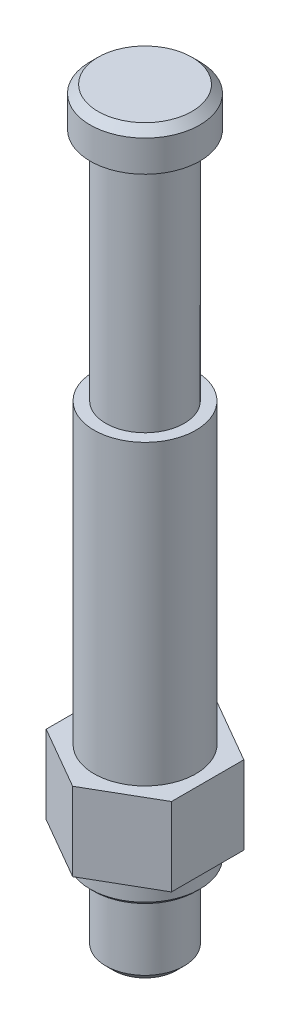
from build123d import *

# Parameters (mm, degrees)
CHANFREIN1_SIZE              = 1
CHANFREIN2_SIZE              = 0.5
ESQUISSE3_W                  = 9.494413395
ESQUISSE3_H                  = 22.552847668
ENL_V_MAT_EXTRU_1_DEPTH      = 98.036075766
R_P_TITION_CIRCULAIRE1_COUNT = 6


with BuildPart() as part:
    # Esquisse1 → R_volution2 (revolve)
    with BuildSketch(Plane.XY, mode=Mode.PRIVATE) as r_volution2_sk:
        Polygon((0, 96), (-7, 96), (-7, 91), (-5, 91), (-5, 61), (-6.5, 61), (-6.5, 23), (-10, 23), (-10, 13), (-7, 13), (-7, 10), (-5, 10), (-5, 0), (0, 0), align=None)
    revolve(r_volution2_sk.sketch.rotate(Axis((0, 0, 0), (0, 1, 0)), 270), axis=Axis((0, 0, 0), (0, 1, 0)))

    # Chanfrein1
    chanfrein1_edges = [part.edges().sort_by_distance(p)[0] for p in [
        (0, 96, 7),
        (0, 0, 5),
    ]]
    chamfer(chanfrein1_edges, length=CHANFREIN1_SIZE)

    # Chanfrein2
    chanfrein2_edges = [part.edges().sort_by_distance(p)[0] for p in [
        (0, 10, 7),
    ]]
    chamfer(chanfrein2_edges, length=CHANFREIN2_SIZE)

    # Esquisse3 → Enl_v. mat.-Extru.1 (cut, symmetric)
    with BuildSketch(Plane.XY):
        with Locations((-12.747206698, 22.625290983)):
            Rectangle(ESQUISSE3_W, ESQUISSE3_H)
    enl_v_mat_extru_1 = extrude(amount=ENL_V_MAT_EXTRU_1_DEPTH, both=True, mode=Mode.SUBTRACT)

    # R_p_tition circulaire1: Enl_v. mat.-Extru.1 ×6 about axis
    r_p_tition_circulaire1_axis = Axis((0, 0, 0), (0, 1, 0))
    for i in range(1, R_P_TITION_CIRCULAIRE1_COUNT):
        add(enl_v_mat_extru_1.rotate(r_p_tition_circulaire1_axis, i * 360 / R_P_TITION_CIRCULAIRE1_COUNT), mode=Mode.SUBTRACT)


solid = part.part
